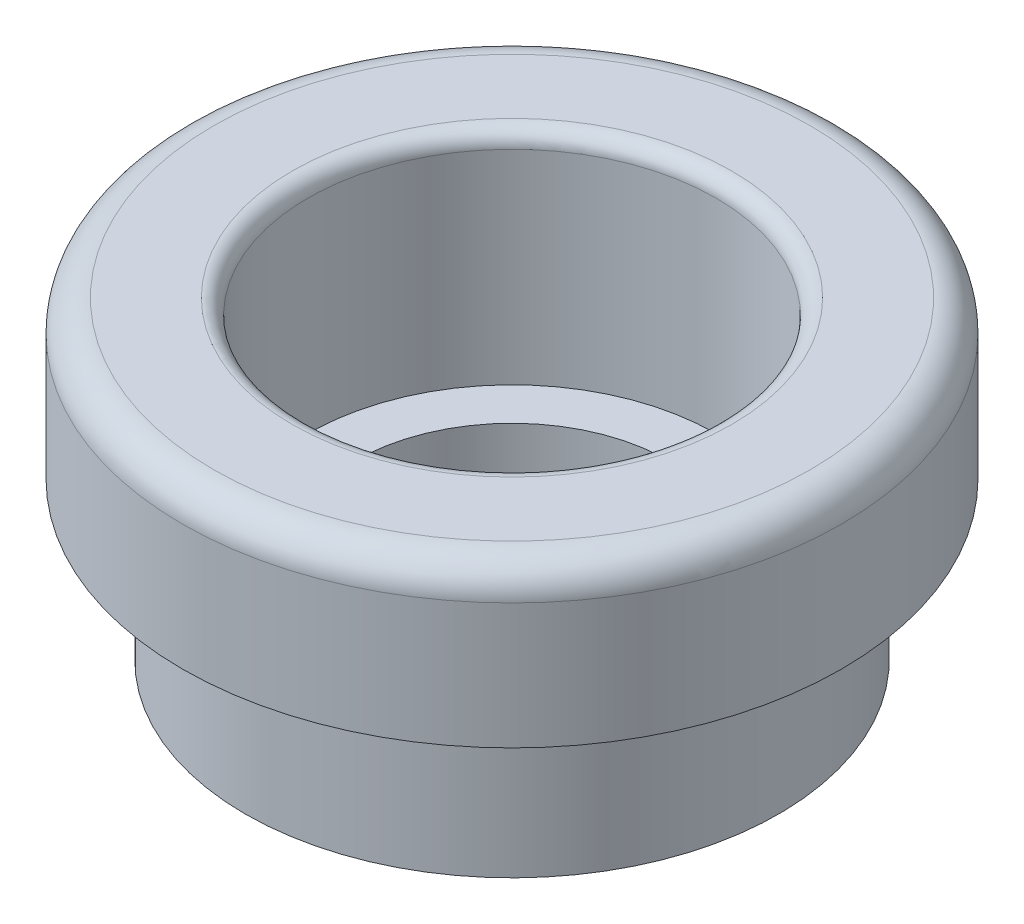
from build123d import *

# Parameters (mm, degrees)
SKETCH1_R           = 8.5
BOSS_EXTRUDE1_DEPTH = 5
SKETCH2_R           = 10.5
BOSS_EXTRUDE2_DEPTH = 5
SKETCH3_R           = 5
CUT_EXTRUDE1_DEPTH  = 18.90251379
SKETCH4_R           = 6.5
CUT_EXTRUDE2_DEPTH  = 7
FILLET1_R           = 1
FILLET2_R           = 0.5


with BuildPart() as part:
    # Sketch1 → Boss-Extrude1 (new body)
    with BuildSketch(Plane(origin=(0, 0, 0), x_dir=(1, 0, 0), z_dir=(0, 1, 0))):
        with Locations(Location((0, 0, 0), (0, 0, 270))):
            Circle(SKETCH1_R)
    extrude(amount=BOSS_EXTRUDE1_DEPTH)

    # Sketch2 → Boss-Extrude2 (add)
    with BuildSketch(Plane(origin=(0, 5, 0), x_dir=(1, 0, 0), z_dir=(0, 1, 0))):
        with Locations(Location((0, 0, 0), (0, 0, 270))):
            Circle(SKETCH2_R)
    extrude(amount=BOSS_EXTRUDE2_DEPTH)

    # Sketch3 → Cut-Extrude1 (cut, through all)
    with BuildSketch(Plane(origin=(0, 10, 0), x_dir=(1, 0, 0), z_dir=(0, 1, 0))):
        with Locations(Location((0, 0, 0), (0, 0, 270))):
            Circle(SKETCH3_R)
    extrude(amount=-CUT_EXTRUDE1_DEPTH, mode=Mode.SUBTRACT)

    # Sketch4 → Cut-Extrude2 (cut)
    with BuildSketch(Plane(origin=(0, 10, 0), x_dir=(1, 0, 0), z_dir=(0, 1, 0))):
        with Locations(Location((0, 0, 0), (0, 0, 270))):
            Circle(SKETCH4_R)
    extrude(amount=-CUT_EXTRUDE2_DEPTH, mode=Mode.SUBTRACT)

    # Fillet1
    fillet1_edges = [part.edges().sort_by_distance(p)[0] for p in [
        (0, 10, -10.5),
    ]]
    fillet(fillet1_edges, radius=FILLET1_R)

    # Fillet2
    fillet2_edges = [part.edges().sort_by_distance(p)[0] for p in [
        (0, 10, -6.5),
    ]]
    fillet(fillet2_edges, radius=FILLET2_R)


solid = part.part
